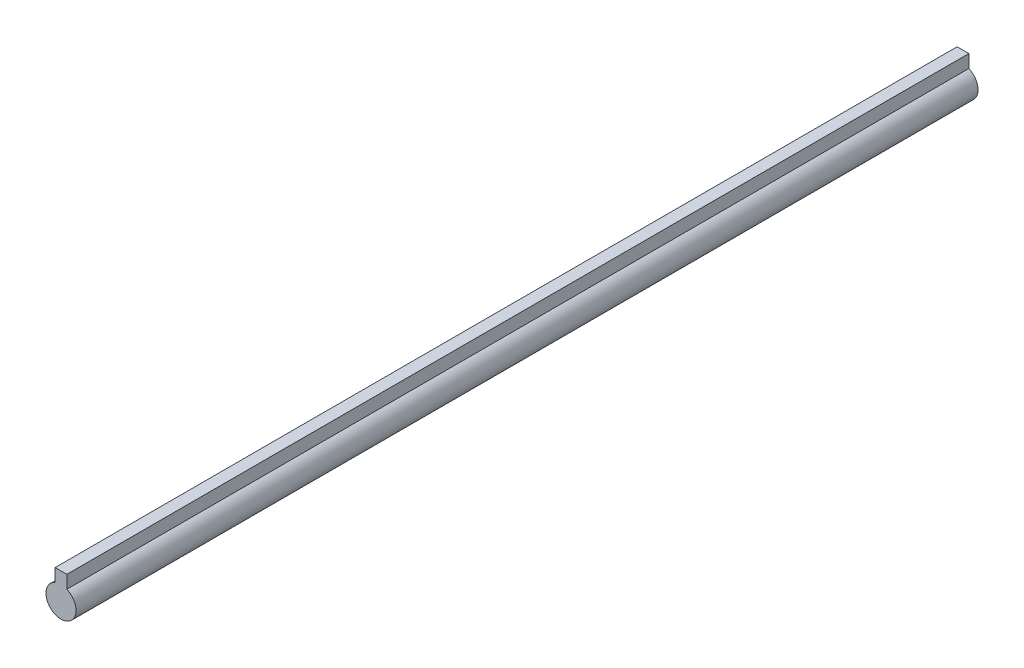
ISO-10303-21;
HEADER;
FILE_DESCRIPTION(('STEP AP214'),'2;1');
FILE_NAME('part.step','',(''),(''),'','','');
FILE_SCHEMA(('AUTOMOTIVE_DESIGN { 1 0 10303 214 1 1 1 1 }'));
ENDSEC;
DATA;
#1=APPLICATION_CONTEXT('core data for automotive mechanical design processes');
#2=APPLICATION_PROTOCOL_DEFINITION('international standard','automotive_design',2000,#1);
#3=PRODUCT_CONTEXT('',#1,'mechanical');
#4=PRODUCT('Part','Part','',(#3));
#5=PRODUCT_RELATED_PRODUCT_CATEGORY('part','',(#4));
#6=PRODUCT_DEFINITION_FORMATION('','',#4);
#7=PRODUCT_DEFINITION_CONTEXT('part definition',#1,'design');
#8=PRODUCT_DEFINITION('design','',#6,#7);
#9=PRODUCT_DEFINITION_SHAPE('','',#8);
#10=(LENGTH_UNIT() NAMED_UNIT(*) SI_UNIT(.MILLI.,.METRE.));
#11=(NAMED_UNIT(*) PLANE_ANGLE_UNIT() SI_UNIT($,.RADIAN.));
#12=(NAMED_UNIT(*) SI_UNIT($,.STERADIAN.) SOLID_ANGLE_UNIT());
#13=UNCERTAINTY_MEASURE_WITH_UNIT(LENGTH_MEASURE(1.E-05),#10,'distance_accuracy_value','');
#14=(GEOMETRIC_REPRESENTATION_CONTEXT(3) GLOBAL_UNCERTAINTY_ASSIGNED_CONTEXT((#13)) GLOBAL_UNIT_ASSIGNED_CONTEXT((#10,
#11,#12)) REPRESENTATION_CONTEXT('',''));
#15=CARTESIAN_POINT('',(0.,0.,0.));
#16=DIRECTION('',(0.,0.,1.));
#17=DIRECTION('',(1.,0.,0.));
#18=AXIS2_PLACEMENT_3D('',#15,#16,#17);
#19=CARTESIAN_POINT('',(-1.075,2.53118055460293,-165.));
#20=DIRECTION('',(-1.,0.,0.));
#21=DIRECTION('',(0.,0.,1.));
#22=AXIS2_PLACEMENT_3D('',#19,#20,#21);
#23=PLANE('',#22);
#24=DIRECTION('',(0.,-1.,0.));
#25=VECTOR('',#24,1.);
#26=CARTESIAN_POINT('',(-1.075,2.53118055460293,0.));
#27=LINE('',#26,#25);
#28=CARTESIAN_POINT('',(-1.075,4.9,0.));
#29=VERTEX_POINT('',#28);
#30=CARTESIAN_POINT('',(-1.075,2.53118055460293,0.));
#31=VERTEX_POINT('',#30);
#32=EDGE_CURVE('E101',#29,#31,#27,.T.);
#33=ORIENTED_EDGE('',*,*,#32,.F.);
#34=DIRECTION('',(0.,0.,1.));
#35=VECTOR('',#34,1.);
#36=CARTESIAN_POINT('',(-1.075,4.9,-165.));
#37=LINE('',#36,#35);
#38=CARTESIAN_POINT('',(-1.075,4.9,-165.));
#39=VERTEX_POINT('',#38);
#40=EDGE_CURVE('E11',#39,#29,#37,.T.);
#41=ORIENTED_EDGE('',*,*,#40,.F.);
#42=DIRECTION('',(0.,-1.,0.));
#43=VECTOR('',#42,1.);
#44=CARTESIAN_POINT('',(-1.075,2.53118055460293,-165.));
#45=LINE('',#44,#43);
#46=CARTESIAN_POINT('',(-1.075,2.53118055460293,-165.));
#47=VERTEX_POINT('',#46);
#48=EDGE_CURVE('E95',#39,#47,#45,.T.);
#49=ORIENTED_EDGE('',*,*,#48,.T.);
#50=DIRECTION('',(0.,0.,1.));
#51=VECTOR('',#50,1.);
#52=CARTESIAN_POINT('',(-1.075,2.53118055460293,-165.));
#53=LINE('',#52,#51);
#54=EDGE_CURVE('E40',#47,#31,#53,.T.);
#55=ORIENTED_EDGE('',*,*,#54,.T.);
#56=EDGE_LOOP('',(#33,#41,#49,#55));
#57=FACE_BOUND('',#56,.T.);
#58=ADVANCED_FACE('F37',(#57),#23,.T.);
#59=CARTESIAN_POINT('',(1.075,4.9,-165.));
#60=DIRECTION('',(0.,1.,0.));
#61=DIRECTION('',(0.,0.,1.));
#62=AXIS2_PLACEMENT_3D('',#59,#60,#61);
#63=PLANE('',#62);
#64=DIRECTION('',(-1.,0.,0.));
#65=VECTOR('',#64,1.);
#66=CARTESIAN_POINT('',(1.075,4.9,0.));
#67=LINE('',#66,#65);
#68=CARTESIAN_POINT('',(1.075,4.9,0.));
#69=VERTEX_POINT('',#68);
#70=EDGE_CURVE('E97',#69,#29,#67,.T.);
#71=ORIENTED_EDGE('',*,*,#70,.F.);
#72=DIRECTION('',(0.,0.,1.));
#73=VECTOR('',#72,1.);
#74=CARTESIAN_POINT('',(1.075,4.9,-165.));
#75=LINE('',#74,#73);
#76=CARTESIAN_POINT('',(1.075,4.9,-165.));
#77=VERTEX_POINT('',#76);
#78=EDGE_CURVE('E46',#77,#69,#75,.T.);
#79=ORIENTED_EDGE('',*,*,#78,.F.);
#80=DIRECTION('',(-1.,0.,0.));
#81=VECTOR('',#80,1.);
#82=CARTESIAN_POINT('',(1.075,4.9,-165.));
#83=LINE('',#82,#81);
#84=EDGE_CURVE('E92',#77,#39,#83,.T.);
#85=ORIENTED_EDGE('',*,*,#84,.T.);
#86=ORIENTED_EDGE('',*,*,#40,.T.);
#87=EDGE_LOOP('',(#71,#79,#85,#86));
#88=FACE_BOUND('',#87,.T.);
#89=ADVANCED_FACE('F111',(#88),#63,.T.);
#90=CARTESIAN_POINT('',(1.075,4.9,-165.));
#91=DIRECTION('',(1.,0.,0.));
#92=DIRECTION('',(0.,0.,-1.));
#93=AXIS2_PLACEMENT_3D('',#90,#91,#92);
#94=PLANE('',#93);
#95=DIRECTION('',(0.,1.,0.));
#96=VECTOR('',#95,1.);
#97=CARTESIAN_POINT('',(1.075,4.9,0.));
#98=LINE('',#97,#96);
#99=CARTESIAN_POINT('',(1.075,2.53118055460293,0.));
#100=VERTEX_POINT('',#99);
#101=EDGE_CURVE('E87',#100,#69,#98,.T.);
#102=ORIENTED_EDGE('',*,*,#101,.F.);
#103=DIRECTION('',(0.,0.,1.));
#104=VECTOR('',#103,1.);
#105=CARTESIAN_POINT('',(1.075,2.53118055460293,-165.));
#106=LINE('',#105,#104);
#107=CARTESIAN_POINT('',(1.075,2.53118055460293,-165.));
#108=VERTEX_POINT('',#107);
#109=EDGE_CURVE('E82',#108,#100,#106,.T.);
#110=ORIENTED_EDGE('',*,*,#109,.F.);
#111=DIRECTION('',(0.,1.,0.));
#112=VECTOR('',#111,1.);
#113=CARTESIAN_POINT('',(1.075,4.9,-165.));
#114=LINE('',#113,#112);
#115=EDGE_CURVE('E85',#108,#77,#114,.T.);
#116=ORIENTED_EDGE('',*,*,#115,.T.);
#117=ORIENTED_EDGE('',*,*,#78,.T.);
#118=EDGE_LOOP('',(#102,#110,#116,#117));
#119=FACE_BOUND('',#118,.T.);
#120=ADVANCED_FACE('F84',(#119),#94,.T.);
#121=CARTESIAN_POINT('',(0.,0.,-165.));
#122=DIRECTION('',(0.,0.,1.));
#123=DIRECTION('',(1.,0.,0.));
#124=AXIS2_PLACEMENT_3D('',#121,#122,#123);
#125=CYLINDRICAL_SURFACE('',#124,2.75);
#126=CARTESIAN_POINT('',(0.,0.,0.));
#127=DIRECTION('',(0.,0.,1.));
#128=DIRECTION('',(1.,0.,0.));
#129=AXIS2_PLACEMENT_3D('',#126,#127,#128);
#130=CIRCLE('',#129,2.75);
#131=EDGE_CURVE('E104',#31,#100,#130,.T.);
#132=ORIENTED_EDGE('',*,*,#131,.F.);
#133=ORIENTED_EDGE('',*,*,#54,.F.);
#134=CARTESIAN_POINT('',(0.,0.,-165.));
#135=DIRECTION('',(0.,0.,1.));
#136=DIRECTION('',(1.,0.,0.));
#137=AXIS2_PLACEMENT_3D('',#134,#135,#136);
#138=CIRCLE('',#137,2.75);
#139=EDGE_CURVE('E91',#47,#108,#138,.T.);
#140=ORIENTED_EDGE('',*,*,#139,.T.);
#141=ORIENTED_EDGE('',*,*,#109,.T.);
#142=EDGE_LOOP('',(#132,#133,#140,#141));
#143=FACE_BOUND('',#142,.T.);
#144=ADVANCED_FACE('F94',(#143),#125,.T.);
#145=CARTESIAN_POINT('',(0.,0.,-165.));
#146=DIRECTION('',(0.,0.,1.));
#147=DIRECTION('',(1.,0.,0.));
#148=AXIS2_PLACEMENT_3D('',#145,#146,#147);
#149=PLANE('',#148);
#150=ORIENTED_EDGE('',*,*,#48,.F.);
#151=ORIENTED_EDGE('',*,*,#84,.F.);
#152=ORIENTED_EDGE('',*,*,#115,.F.);
#153=ORIENTED_EDGE('',*,*,#139,.F.);
#154=EDGE_LOOP('',(#150,#151,#152,#153));
#155=FACE_BOUND('',#154,.T.);
#156=ADVANCED_FACE('F90',(#155),#149,.F.);
#157=CARTESIAN_POINT('',(0.,0.,0.));
#158=DIRECTION('',(0.,0.,1.));
#159=DIRECTION('',(1.,0.,0.));
#160=AXIS2_PLACEMENT_3D('',#157,#158,#159);
#161=PLANE('',#160);
#162=ORIENTED_EDGE('',*,*,#32,.T.);
#163=ORIENTED_EDGE('',*,*,#131,.T.);
#164=ORIENTED_EDGE('',*,*,#101,.T.);
#165=ORIENTED_EDGE('',*,*,#70,.T.);
#166=EDGE_LOOP('',(#162,#163,#164,#165));
#167=FACE_BOUND('',#166,.T.);
#168=ADVANCED_FACE('F110',(#167),#161,.T.);
#169=CLOSED_SHELL('',(#58,#89,#120,#144,#156,#168));
#170=MANIFOLD_SOLID_BREP('B2',#169);
#171=ADVANCED_BREP_SHAPE_REPRESENTATION('',(#18,#170),#14);
#172=SHAPE_DEFINITION_REPRESENTATION(#9,#171);
ENDSEC;
END-ISO-10303-21;
